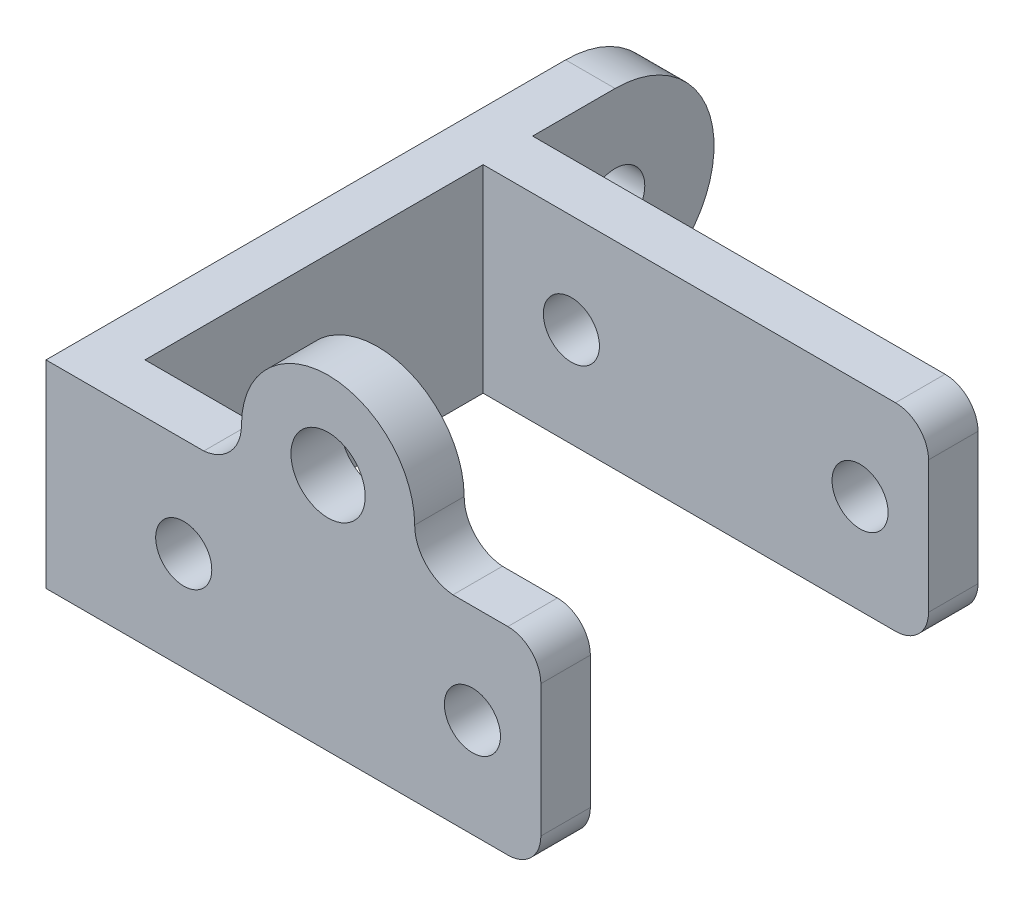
ISO-10303-21;
HEADER;
FILE_DESCRIPTION(('STEP AP214'),'2;1');
FILE_NAME('part.step','',(''),(''),'','','');
FILE_SCHEMA(('AUTOMOTIVE_DESIGN { 1 0 10303 214 1 1 1 1 }'));
ENDSEC;
DATA;
#1=APPLICATION_CONTEXT('core data for automotive mechanical design processes');
#2=APPLICATION_PROTOCOL_DEFINITION('international standard','automotive_design',2000,#1);
#3=PRODUCT_CONTEXT('',#1,'mechanical');
#4=PRODUCT('Part','Part','',(#3));
#5=PRODUCT_RELATED_PRODUCT_CATEGORY('part','',(#4));
#6=PRODUCT_DEFINITION_FORMATION('','',#4);
#7=PRODUCT_DEFINITION_CONTEXT('part definition',#1,'design');
#8=PRODUCT_DEFINITION('design','',#6,#7);
#9=PRODUCT_DEFINITION_SHAPE('','',#8);
#10=(LENGTH_UNIT() NAMED_UNIT(*) SI_UNIT(.MILLI.,.METRE.));
#11=(NAMED_UNIT(*) PLANE_ANGLE_UNIT() SI_UNIT($,.RADIAN.));
#12=(NAMED_UNIT(*) SI_UNIT($,.STERADIAN.) SOLID_ANGLE_UNIT());
#13=UNCERTAINTY_MEASURE_WITH_UNIT(LENGTH_MEASURE(1.E-05),#10,'distance_accuracy_value','');
#14=(GEOMETRIC_REPRESENTATION_CONTEXT(3) GLOBAL_UNCERTAINTY_ASSIGNED_CONTEXT((#13)) GLOBAL_UNIT_ASSIGNED_CONTEXT((#10,
#11,#12)) REPRESENTATION_CONTEXT('',''));
#15=CARTESIAN_POINT('',(0.,0.,0.));
#16=DIRECTION('',(0.,0.,1.));
#17=DIRECTION('',(1.,0.,0.));
#18=AXIS2_PLACEMENT_3D('',#15,#16,#17);
#19=CARTESIAN_POINT('',(-15.,6.,26.5));
#20=DIRECTION('',(0.,-1.,0.));
#21=DIRECTION('',(0.,0.,-1.));
#22=AXIS2_PLACEMENT_3D('',#19,#20,#21);
#23=PLANE('',#22);
#24=DIRECTION('',(-1.,0.,0.));
#25=VECTOR('',#24,1.);
#26=CARTESIAN_POINT('',(-15.,6.,3.));
#27=LINE('',#26,#25);
#28=CARTESIAN_POINT('',(13.,6.,3.));
#29=VERTEX_POINT('',#28);
#30=CARTESIAN_POINT('',(-12.,6.,3.));
#31=VERTEX_POINT('',#30);
#32=EDGE_CURVE('E288',#29,#31,#27,.T.);
#33=ORIENTED_EDGE('',*,*,#32,.F.);
#34=DIRECTION('',(0.,0.,-1.));
#35=VECTOR('',#34,1.);
#36=CARTESIAN_POINT('',(13.,6.,26.5));
#37=LINE('',#36,#35);
#38=CARTESIAN_POINT('',(13.,6.,0.));
#39=VERTEX_POINT('',#38);
#40=EDGE_CURVE('E255',#29,#39,#37,.T.);
#41=ORIENTED_EDGE('',*,*,#40,.T.);
#42=DIRECTION('',(-1.,0.,0.));
#43=VECTOR('',#42,1.);
#44=CARTESIAN_POINT('',(-15.,6.,0.));
#45=LINE('',#44,#43);
#46=CARTESIAN_POINT('',(-12.,6.,0.));
#47=VERTEX_POINT('',#46);
#48=EDGE_CURVE('E188',#39,#47,#45,.T.);
#49=ORIENTED_EDGE('',*,*,#48,.T.);
#50=DIRECTION('',(0.,0.,-1.));
#51=VECTOR('',#50,1.);
#52=CARTESIAN_POINT('',(-12.,6.,-4.99999999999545));
#53=LINE('',#52,#51);
#54=CARTESIAN_POINT('',(-12.,6.,-4.99999999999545));
#55=VERTEX_POINT('',#54);
#56=EDGE_CURVE('E168',#47,#55,#53,.T.);
#57=ORIENTED_EDGE('',*,*,#56,.T.);
#58=DIRECTION('',(-1.,0.,0.));
#59=VECTOR('',#58,1.);
#60=CARTESIAN_POINT('',(4.27882059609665,6.,-4.99999999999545));
#61=LINE('',#60,#59);
#62=CARTESIAN_POINT('',(-15.,6.,-4.99999999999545));
#63=VERTEX_POINT('',#62);
#64=EDGE_CURVE('E172',#55,#63,#61,.T.);
#65=ORIENTED_EDGE('',*,*,#64,.T.);
#66=DIRECTION('',(0.,0.,-1.));
#67=VECTOR('',#66,1.);
#68=CARTESIAN_POINT('',(-15.,6.,26.5));
#69=LINE('',#68,#67);
#70=CARTESIAN_POINT('',(-15.,6.,26.5));
#71=VERTEX_POINT('',#70);
#72=EDGE_CURVE('E207',#71,#63,#69,.T.);
#73=ORIENTED_EDGE('',*,*,#72,.F.);
#74=DIRECTION('',(-1.,0.,0.));
#75=VECTOR('',#74,1.);
#76=CARTESIAN_POINT('',(-15.,6.,26.5));
#77=LINE('',#76,#75);
#78=CARTESIAN_POINT('',(-5.43354923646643,6.,26.5));
#79=VERTEX_POINT('',#78);
#80=EDGE_CURVE('E190',#79,#71,#77,.T.);
#81=ORIENTED_EDGE('',*,*,#80,.F.);
#82=DIRECTION('',(0.,0.,1.));
#83=VECTOR('',#82,1.);
#84=CARTESIAN_POINT('',(-5.43354923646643,6.,23.5));
#85=LINE('',#84,#83);
#86=CARTESIAN_POINT('',(-5.43354923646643,6.,23.5));
#87=VERTEX_POINT('',#86);
#88=EDGE_CURVE('E361',#87,#79,#85,.T.);
#89=ORIENTED_EDGE('',*,*,#88,.F.);
#90=DIRECTION('',(-1.,0.,0.));
#91=VECTOR('',#90,1.);
#92=CARTESIAN_POINT('',(-15.,6.,23.5));
#93=LINE('',#92,#91);
#94=CARTESIAN_POINT('',(-12.,6.,23.5));
#95=VERTEX_POINT('',#94);
#96=EDGE_CURVE('E224',#87,#95,#93,.T.);
#97=ORIENTED_EDGE('',*,*,#96,.T.);
#98=DIRECTION('',(0.,0.,-1.));
#99=VECTOR('',#98,1.);
#100=CARTESIAN_POINT('',(-12.,6.,26.5));
#101=LINE('',#100,#99);
#102=EDGE_CURVE('E264',#95,#31,#101,.T.);
#103=ORIENTED_EDGE('',*,*,#102,.T.);
#104=EDGE_LOOP('',(#33,#41,#49,#57,#65,#73,#81,#89,#97,#103));
#105=FACE_BOUND('',#104,.T.);
#106=ADVANCED_FACE('F35',(#105),#23,.F.);
#107=CARTESIAN_POINT('',(15.,6.,26.5));
#108=DIRECTION('',(-1.,0.,0.));
#109=DIRECTION('',(0.,-1.,0.));
#110=AXIS2_PLACEMENT_3D('',#107,#108,#109);
#111=PLANE('',#110);
#112=DIRECTION('',(0.,1.,0.));
#113=VECTOR('',#112,1.);
#114=CARTESIAN_POINT('',(15.,6.,3.));
#115=LINE('',#114,#113);
#116=CARTESIAN_POINT('',(15.,-4.,3.));
#117=VERTEX_POINT('',#116);
#118=CARTESIAN_POINT('',(15.,4.,3.));
#119=VERTEX_POINT('',#118);
#120=EDGE_CURVE('E286',#117,#119,#115,.T.);
#121=ORIENTED_EDGE('',*,*,#120,.F.);
#122=DIRECTION('',(0.,0.,-1.));
#123=VECTOR('',#122,1.);
#124=CARTESIAN_POINT('',(15.,-4.,26.5));
#125=LINE('',#124,#123);
#126=CARTESIAN_POINT('',(15.,-4.,0.));
#127=VERTEX_POINT('',#126);
#128=EDGE_CURVE('E315',#117,#127,#125,.T.);
#129=ORIENTED_EDGE('',*,*,#128,.T.);
#130=DIRECTION('',(0.,1.,0.));
#131=VECTOR('',#130,1.);
#132=CARTESIAN_POINT('',(15.,6.,0.));
#133=LINE('',#132,#131);
#134=CARTESIAN_POINT('',(15.,4.,0.));
#135=VERTEX_POINT('',#134);
#136=EDGE_CURVE('E192',#127,#135,#133,.T.);
#137=ORIENTED_EDGE('',*,*,#136,.T.);
#138=DIRECTION('',(0.,0.,-1.));
#139=VECTOR('',#138,1.);
#140=CARTESIAN_POINT('',(15.,4.,26.5));
#141=LINE('',#140,#139);
#142=EDGE_CURVE('E210',#135,#119,#141,.F.);
#143=ORIENTED_EDGE('',*,*,#142,.T.);
#144=EDGE_LOOP('',(#121,#129,#137,#143));
#145=FACE_BOUND('',#144,.T.);
#146=ADVANCED_FACE('F320',(#145),#111,.F.);
#147=CARTESIAN_POINT('',(13.,6.,26.5));
#148=VERTEX_POINT('',#147);
#149=CARTESIAN_POINT('',(9.66914453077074,6.,26.5));
#150=VERTEX_POINT('',#149);
#151=EDGE_CURVE('E223',#148,#150,#77,.T.);
#152=ORIENTED_EDGE('',*,*,#151,.F.);
#153=DIRECTION('',(0.,0.,-1.));
#154=VECTOR('',#153,1.);
#155=CARTESIAN_POINT('',(13.,6.,26.5));
#156=LINE('',#155,#154);
#157=CARTESIAN_POINT('',(13.,6.,23.5));
#158=VERTEX_POINT('',#157);
#159=EDGE_CURVE('E11',#148,#158,#156,.T.);
#160=ORIENTED_EDGE('',*,*,#159,.T.);
#161=CARTESIAN_POINT('',(9.66914453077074,6.,23.5));
#162=VERTEX_POINT('',#161);
#163=EDGE_CURVE('E259',#158,#162,#93,.T.);
#164=ORIENTED_EDGE('',*,*,#163,.T.);
#165=DIRECTION('',(0.,0.,1.));
#166=VECTOR('',#165,1.);
#167=CARTESIAN_POINT('',(9.66914453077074,6.,23.5));
#168=LINE('',#167,#166);
#169=EDGE_CURVE('E352',#162,#150,#168,.T.);
#170=ORIENTED_EDGE('',*,*,#169,.T.);
#171=EDGE_LOOP('',(#152,#160,#164,#170));
#172=FACE_BOUND('',#171,.T.);
#173=ADVANCED_FACE('F383',(#172),#23,.F.);
#174=CARTESIAN_POINT('',(-15.,-6.,26.5));
#175=DIRECTION('',(0.,1.,0.));
#176=DIRECTION('',(0.,0.,1.));
#177=AXIS2_PLACEMENT_3D('',#174,#175,#176);
#178=PLANE('',#177);
#179=DIRECTION('',(1.,0.,0.));
#180=VECTOR('',#179,1.);
#181=CARTESIAN_POINT('',(-15.,-6.,0.));
#182=LINE('',#181,#180);
#183=CARTESIAN_POINT('',(-12.,-6.,0.));
#184=VERTEX_POINT('',#183);
#185=CARTESIAN_POINT('',(13.,-6.,0.));
#186=VERTEX_POINT('',#185);
#187=EDGE_CURVE('E178',#184,#186,#182,.T.);
#188=ORIENTED_EDGE('',*,*,#187,.T.);
#189=DIRECTION('',(0.,0.,-1.));
#190=VECTOR('',#189,1.);
#191=CARTESIAN_POINT('',(13.,-6.,26.5));
#192=LINE('',#191,#190);
#193=CARTESIAN_POINT('',(13.,-6.,3.));
#194=VERTEX_POINT('',#193);
#195=EDGE_CURVE('E297',#186,#194,#192,.F.);
#196=ORIENTED_EDGE('',*,*,#195,.T.);
#197=DIRECTION('',(1.,0.,0.));
#198=VECTOR('',#197,1.);
#199=CARTESIAN_POINT('',(-15.,-6.,3.));
#200=LINE('',#199,#198);
#201=CARTESIAN_POINT('',(-12.,-6.,3.));
#202=VERTEX_POINT('',#201);
#203=EDGE_CURVE('E268',#202,#194,#200,.T.);
#204=ORIENTED_EDGE('',*,*,#203,.F.);
#205=DIRECTION('',(0.,0.,-1.));
#206=VECTOR('',#205,1.);
#207=CARTESIAN_POINT('',(-12.,-6.,26.5));
#208=LINE('',#207,#206);
#209=CARTESIAN_POINT('',(-12.,-6.,23.5));
#210=VERTEX_POINT('',#209);
#211=EDGE_CURVE('E271',#210,#202,#208,.T.);
#212=ORIENTED_EDGE('',*,*,#211,.F.);
#213=DIRECTION('',(1.,0.,0.));
#214=VECTOR('',#213,1.);
#215=CARTESIAN_POINT('',(-15.,-6.,23.5));
#216=LINE('',#215,#214);
#217=CARTESIAN_POINT('',(13.,-6.,23.5));
#218=VERTEX_POINT('',#217);
#219=EDGE_CURVE('E269',#210,#218,#216,.T.);
#220=ORIENTED_EDGE('',*,*,#219,.T.);
#221=DIRECTION('',(0.,0.,-1.));
#222=VECTOR('',#221,1.);
#223=CARTESIAN_POINT('',(13.,-6.,26.5));
#224=LINE('',#223,#222);
#225=CARTESIAN_POINT('',(13.,-6.,26.5));
#226=VERTEX_POINT('',#225);
#227=EDGE_CURVE('E300',#218,#226,#224,.F.);
#228=ORIENTED_EDGE('',*,*,#227,.T.);
#229=DIRECTION('',(1.,0.,0.));
#230=VECTOR('',#229,1.);
#231=CARTESIAN_POINT('',(-15.,-6.,26.5));
#232=LINE('',#231,#230);
#233=CARTESIAN_POINT('',(-15.,-6.,26.5));
#234=VERTEX_POINT('',#233);
#235=EDGE_CURVE('E208',#234,#226,#232,.T.);
#236=ORIENTED_EDGE('',*,*,#235,.F.);
#237=DIRECTION('',(0.,0.,-1.));
#238=VECTOR('',#237,1.);
#239=CARTESIAN_POINT('',(-15.,-6.,26.5));
#240=LINE('',#239,#238);
#241=CARTESIAN_POINT('',(-15.,-6.,-4.99999999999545));
#242=VERTEX_POINT('',#241);
#243=EDGE_CURVE('E205',#234,#242,#240,.T.);
#244=ORIENTED_EDGE('',*,*,#243,.T.);
#245=DIRECTION('',(-1.,0.,0.));
#246=VECTOR('',#245,1.);
#247=CARTESIAN_POINT('',(4.27882059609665,-6.,-4.99999999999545));
#248=LINE('',#247,#246);
#249=CARTESIAN_POINT('',(-12.,-6.,-4.99999999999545));
#250=VERTEX_POINT('',#249);
#251=EDGE_CURVE('E181',#250,#242,#248,.T.);
#252=ORIENTED_EDGE('',*,*,#251,.F.);
#253=DIRECTION('',(0.,0.,1.));
#254=VECTOR('',#253,1.);
#255=CARTESIAN_POINT('',(-12.,-6.,0.));
#256=LINE('',#255,#254);
#257=EDGE_CURVE('E165',#250,#184,#256,.T.);
#258=ORIENTED_EDGE('',*,*,#257,.T.);
#259=EDGE_LOOP('',(#188,#196,#204,#212,#220,#228,#236,#244,#252,#258));
#260=FACE_BOUND('',#259,.T.);
#261=ADVANCED_FACE('F177',(#260),#178,.F.);
#262=DIRECTION('',(0.,1.,0.));
#263=VECTOR('',#262,1.);
#264=CARTESIAN_POINT('',(15.,6.,26.5));
#265=LINE('',#264,#263);
#266=CARTESIAN_POINT('',(15.,-4.,26.5));
#267=VERTEX_POINT('',#266);
#268=CARTESIAN_POINT('',(15.,4.,26.5));
#269=VERTEX_POINT('',#268);
#270=EDGE_CURVE('E187',#267,#269,#265,.T.);
#271=ORIENTED_EDGE('',*,*,#270,.F.);
#272=DIRECTION('',(0.,0.,-1.));
#273=VECTOR('',#272,1.);
#274=CARTESIAN_POINT('',(15.,-4.,26.5));
#275=LINE('',#274,#273);
#276=CARTESIAN_POINT('',(15.,-4.,23.5));
#277=VERTEX_POINT('',#276);
#278=EDGE_CURVE('E250',#267,#277,#275,.T.);
#279=ORIENTED_EDGE('',*,*,#278,.T.);
#280=DIRECTION('',(0.,1.,0.));
#281=VECTOR('',#280,1.);
#282=CARTESIAN_POINT('',(15.,6.,23.5));
#283=LINE('',#282,#281);
#284=CARTESIAN_POINT('',(15.,4.,23.5));
#285=VERTEX_POINT('',#284);
#286=EDGE_CURVE('E266',#277,#285,#283,.T.);
#287=ORIENTED_EDGE('',*,*,#286,.T.);
#288=DIRECTION('',(0.,0.,-1.));
#289=VECTOR('',#288,1.);
#290=CARTESIAN_POINT('',(15.,4.,26.5));
#291=LINE('',#290,#289);
#292=EDGE_CURVE('E252',#285,#269,#291,.F.);
#293=ORIENTED_EDGE('',*,*,#292,.T.);
#294=EDGE_LOOP('',(#271,#279,#287,#293));
#295=FACE_BOUND('',#294,.T.);
#296=ADVANCED_FACE('F248',(#295),#111,.F.);
#297=CARTESIAN_POINT('',(-15.,6.,26.5));
#298=DIRECTION('',(1.,0.,0.));
#299=DIRECTION('',(0.,1.,0.));
#300=AXIS2_PLACEMENT_3D('',#297,#298,#299);
#301=PLANE('',#300);
#302=ORIENTED_EDGE('',*,*,#72,.T.);
#303=CARTESIAN_POINT('',(-15.,0.,-4.99999999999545));
#304=DIRECTION('',(-1.,0.,0.));
#305=DIRECTION('',(0.,-1.,0.));
#306=AXIS2_PLACEMENT_3D('',#303,#304,#305);
#307=CIRCLE('',#306,6.);
#308=EDGE_CURVE('E433',#63,#242,#307,.T.);
#309=ORIENTED_EDGE('',*,*,#308,.T.);
#310=ORIENTED_EDGE('',*,*,#243,.F.);
#311=DIRECTION('',(0.,-1.,0.));
#312=VECTOR('',#311,1.);
#313=CARTESIAN_POINT('',(-15.,6.,26.5));
#314=LINE('',#313,#312);
#315=EDGE_CURVE('E230',#71,#234,#314,.T.);
#316=ORIENTED_EDGE('',*,*,#315,.F.);
#317=EDGE_LOOP('',(#302,#309,#310,#316));
#318=FACE_BOUND('',#317,.T.);
#319=CARTESIAN_POINT('',(-15.,0.,-4.99999999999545));
#320=DIRECTION('',(-1.,0.,0.));
#321=DIRECTION('',(0.,-1.,0.));
#322=AXIS2_PLACEMENT_3D('',#319,#320,#321);
#323=CIRCLE('',#322,1.8);
#324=CARTESIAN_POINT('',(-15.,-1.8,-4.99999999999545));
#325=VERTEX_POINT('',#324);
#326=EDGE_CURVE('E182',#325,#325,#323,.T.);
#327=ORIENTED_EDGE('',*,*,#326,.F.);
#328=EDGE_LOOP('',(#327));
#329=FACE_BOUND('',#328,.T.);
#330=ADVANCED_FACE('F419',(#318,#329),#301,.F.);
#331=CARTESIAN_POINT('',(0.,0.,26.5));
#332=DIRECTION('',(0.,0.,1.));
#333=DIRECTION('',(1.,0.,0.));
#334=AXIS2_PLACEMENT_3D('',#331,#332,#333);
#335=PLANE('',#334);
#336=CARTESIAN_POINT('',(2.10000000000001,8.49999999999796,26.5));
#337=DIRECTION('',(0.,0.,1.));
#338=DIRECTION('',(-1.,0.,0.));
#339=AXIS2_PLACEMENT_3D('',#336,#337,#338);
#340=CIRCLE('',#339,2.25);
#341=CARTESIAN_POINT('',(-0.149999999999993,8.49999999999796,26.5));
#342=VERTEX_POINT('',#341);
#343=EDGE_CURVE('E679',#342,#342,#340,.T.);
#344=ORIENTED_EDGE('',*,*,#343,.F.);
#345=EDGE_LOOP('',(#344));
#346=FACE_BOUND('',#345,.T.);
#347=CARTESIAN_POINT('',(10.85,0.,26.5));
#348=DIRECTION('',(0.,0.,1.));
#349=DIRECTION('',(1.,0.,0.));
#350=AXIS2_PLACEMENT_3D('',#347,#348,#349);
#351=CIRCLE('',#350,1.7);
#352=CARTESIAN_POINT('',(12.55,0.,26.5));
#353=VERTEX_POINT('',#352);
#354=EDGE_CURVE('E351',#353,#353,#351,.T.);
#355=ORIENTED_EDGE('',*,*,#354,.F.);
#356=EDGE_LOOP('',(#355));
#357=FACE_BOUND('',#356,.T.);
#358=CARTESIAN_POINT('',(-6.64999999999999,0.,26.5));
#359=DIRECTION('',(0.,0.,1.));
#360=DIRECTION('',(1.,0.,0.));
#361=AXIS2_PLACEMENT_3D('',#358,#359,#360);
#362=CIRCLE('',#361,1.7);
#363=CARTESIAN_POINT('',(-4.94999999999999,0.,26.5));
#364=VERTEX_POINT('',#363);
#365=EDGE_CURVE('E486',#364,#364,#362,.T.);
#366=ORIENTED_EDGE('',*,*,#365,.F.);
#367=EDGE_LOOP('',(#366));
#368=FACE_BOUND('',#367,.T.);
#369=ORIENTED_EDGE('',*,*,#235,.T.);
#370=CARTESIAN_POINT('',(13.,-4.,26.5));
#371=DIRECTION('',(0.,0.,1.));
#372=DIRECTION('',(1.,0.,0.));
#373=AXIS2_PLACEMENT_3D('',#370,#371,#372);
#374=CIRCLE('',#373,2.);
#375=EDGE_CURVE('E43',#226,#267,#374,.T.);
#376=ORIENTED_EDGE('',*,*,#375,.T.);
#377=ORIENTED_EDGE('',*,*,#270,.T.);
#378=CARTESIAN_POINT('',(13.,4.,26.5));
#379=DIRECTION('',(0.,0.,1.));
#380=DIRECTION('',(1.,0.,0.));
#381=AXIS2_PLACEMENT_3D('',#378,#379,#380);
#382=CIRCLE('',#381,2.);
#383=EDGE_CURVE('E50',#269,#148,#382,.T.);
#384=ORIENTED_EDGE('',*,*,#383,.T.);
#385=ORIENTED_EDGE('',*,*,#151,.T.);
#386=CARTESIAN_POINT('',(9.8570518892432,8.49999999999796,26.5));
#387=DIRECTION('',(0.,0.,-1.));
#388=DIRECTION('',(1.,0.,0.));
#389=AXIS2_PLACEMENT_3D('',#386,#387,#388);
#390=CIRCLE('',#389,2.50705188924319);
#391=CARTESIAN_POINT('',(7.35000000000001,8.49999999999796,26.5));
#392=VERTEX_POINT('',#391);
#393=EDGE_CURVE('E343',#150,#392,#390,.T.);
#394=ORIENTED_EDGE('',*,*,#393,.T.);
#395=CARTESIAN_POINT('',(2.10000000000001,8.49999999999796,26.5));
#396=DIRECTION('',(0.,0.,1.));
#397=DIRECTION('',(-1.,0.,0.));
#398=AXIS2_PLACEMENT_3D('',#395,#396,#397);
#399=CIRCLE('',#398,5.25);
#400=CARTESIAN_POINT('',(-3.14999999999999,8.49999999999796,26.5));
#401=VERTEX_POINT('',#400);
#402=EDGE_CURVE('E344',#392,#401,#399,.T.);
#403=ORIENTED_EDGE('',*,*,#402,.T.);
#404=CARTESIAN_POINT('',(-5.66025835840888,8.49999999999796,26.5));
#405=DIRECTION('',(0.,0.,-1.));
#406=DIRECTION('',(-1.,0.,0.));
#407=AXIS2_PLACEMENT_3D('',#404,#405,#406);
#408=CIRCLE('',#407,2.51025835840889);
#409=EDGE_CURVE('E347',#401,#79,#408,.T.);
#410=ORIENTED_EDGE('',*,*,#409,.T.);
#411=ORIENTED_EDGE('',*,*,#80,.T.);
#412=ORIENTED_EDGE('',*,*,#315,.T.);
#413=EDGE_LOOP('',(#369,#376,#377,#384,#385,#394,#403,#410,#411,#412));
#414=FACE_BOUND('',#413,.T.);
#415=ADVANCED_FACE('F241',(#346,#357,#368,#414),#335,.T.);
#416=CARTESIAN_POINT('',(0.,0.,0.));
#417=DIRECTION('',(0.,0.,1.));
#418=DIRECTION('',(1.,0.,0.));
#419=AXIS2_PLACEMENT_3D('',#416,#417,#418);
#420=PLANE('',#419);
#421=CARTESIAN_POINT('',(10.85,0.,0.));
#422=DIRECTION('',(0.,0.,1.));
#423=DIRECTION('',(1.,0.,0.));
#424=AXIS2_PLACEMENT_3D('',#421,#422,#423);
#425=CIRCLE('',#424,1.7);
#426=CARTESIAN_POINT('',(12.55,0.,0.));
#427=VERTEX_POINT('',#426);
#428=EDGE_CURVE('E220',#427,#427,#425,.T.);
#429=ORIENTED_EDGE('',*,*,#428,.T.);
#430=EDGE_LOOP('',(#429));
#431=FACE_BOUND('',#430,.T.);
#432=CARTESIAN_POINT('',(-6.64999999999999,0.,0.));
#433=DIRECTION('',(0.,0.,1.));
#434=DIRECTION('',(1.,0.,0.));
#435=AXIS2_PLACEMENT_3D('',#432,#433,#434);
#436=CIRCLE('',#435,1.7);
#437=CARTESIAN_POINT('',(-4.94999999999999,0.,0.));
#438=VERTEX_POINT('',#437);
#439=EDGE_CURVE('E215',#438,#438,#436,.T.);
#440=ORIENTED_EDGE('',*,*,#439,.T.);
#441=EDGE_LOOP('',(#440));
#442=FACE_BOUND('',#441,.T.);
#443=ORIENTED_EDGE('',*,*,#136,.F.);
#444=CARTESIAN_POINT('',(13.,-4.,0.));
#445=DIRECTION('',(0.,0.,1.));
#446=DIRECTION('',(1.,0.,0.));
#447=AXIS2_PLACEMENT_3D('',#444,#445,#446);
#448=CIRCLE('',#447,2.);
#449=EDGE_CURVE('E186',#127,#186,#448,.F.);
#450=ORIENTED_EDGE('',*,*,#449,.T.);
#451=ORIENTED_EDGE('',*,*,#187,.F.);
#452=DIRECTION('',(0.,1.,0.));
#453=VECTOR('',#452,1.);
#454=CARTESIAN_POINT('',(-12.,6.,0.));
#455=LINE('',#454,#453);
#456=EDGE_CURVE('E161',#184,#47,#455,.T.);
#457=ORIENTED_EDGE('',*,*,#456,.T.);
#458=ORIENTED_EDGE('',*,*,#48,.F.);
#459=CARTESIAN_POINT('',(13.,4.,0.));
#460=DIRECTION('',(0.,0.,1.));
#461=DIRECTION('',(1.,0.,0.));
#462=AXIS2_PLACEMENT_3D('',#459,#460,#461);
#463=CIRCLE('',#462,2.);
#464=EDGE_CURVE('E312',#39,#135,#463,.F.);
#465=ORIENTED_EDGE('',*,*,#464,.T.);
#466=EDGE_LOOP('',(#443,#450,#451,#457,#458,#465));
#467=FACE_BOUND('',#466,.T.);
#468=ADVANCED_FACE('F185',(#431,#442,#467),#420,.F.);
#469=CARTESIAN_POINT('',(-12.,6.,26.5));
#470=DIRECTION('',(1.,0.,0.));
#471=DIRECTION('',(0.,1.,0.));
#472=AXIS2_PLACEMENT_3D('',#469,#470,#471);
#473=PLANE('',#472);
#474=DIRECTION('',(0.,-1.,0.));
#475=VECTOR('',#474,1.);
#476=CARTESIAN_POINT('',(-12.,6.,3.));
#477=LINE('',#476,#475);
#478=EDGE_CURVE('E281',#31,#202,#477,.T.);
#479=ORIENTED_EDGE('',*,*,#478,.F.);
#480=ORIENTED_EDGE('',*,*,#102,.F.);
#481=DIRECTION('',(0.,-1.,0.));
#482=VECTOR('',#481,1.);
#483=CARTESIAN_POINT('',(-12.,6.,23.5));
#484=LINE('',#483,#482);
#485=EDGE_CURVE('E260',#95,#210,#484,.T.);
#486=ORIENTED_EDGE('',*,*,#485,.T.);
#487=ORIENTED_EDGE('',*,*,#211,.T.);
#488=EDGE_LOOP('',(#479,#480,#486,#487));
#489=FACE_BOUND('',#488,.T.);
#490=ADVANCED_FACE('F296',(#489),#473,.T.);
#491=CARTESIAN_POINT('',(0.,0.,23.5));
#492=DIRECTION('',(0.,0.,1.));
#493=DIRECTION('',(1.,0.,0.));
#494=AXIS2_PLACEMENT_3D('',#491,#492,#493);
#495=PLANE('',#494);
#496=CARTESIAN_POINT('',(2.10000000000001,8.49999999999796,23.5));
#497=DIRECTION('',(0.,0.,1.));
#498=DIRECTION('',(1.,0.,0.));
#499=AXIS2_PLACEMENT_3D('',#496,#497,#498);
#500=CIRCLE('',#499,2.25);
#501=CARTESIAN_POINT('',(4.35000000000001,8.49999999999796,23.5));
#502=VERTEX_POINT('',#501);
#503=EDGE_CURVE('E336',#502,#502,#500,.F.);
#504=ORIENTED_EDGE('',*,*,#503,.F.);
#505=EDGE_LOOP('',(#504));
#506=FACE_BOUND('',#505,.T.);
#507=CARTESIAN_POINT('',(10.85,0.,23.5));
#508=DIRECTION('',(0.,0.,1.));
#509=DIRECTION('',(1.,0.,0.));
#510=AXIS2_PLACEMENT_3D('',#507,#508,#509);
#511=CIRCLE('',#510,1.7);
#512=CARTESIAN_POINT('',(12.55,0.,23.5));
#513=VERTEX_POINT('',#512);
#514=EDGE_CURVE('E219',#513,#513,#511,.T.);
#515=ORIENTED_EDGE('',*,*,#514,.T.);
#516=EDGE_LOOP('',(#515));
#517=FACE_BOUND('',#516,.T.);
#518=CARTESIAN_POINT('',(-6.64999999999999,0.,23.5));
#519=DIRECTION('',(0.,0.,1.));
#520=DIRECTION('',(1.,0.,0.));
#521=AXIS2_PLACEMENT_3D('',#518,#519,#520);
#522=CIRCLE('',#521,1.7);
#523=CARTESIAN_POINT('',(-4.94999999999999,0.,23.5));
#524=VERTEX_POINT('',#523);
#525=EDGE_CURVE('E214',#524,#524,#522,.T.);
#526=ORIENTED_EDGE('',*,*,#525,.T.);
#527=EDGE_LOOP('',(#526));
#528=FACE_BOUND('',#527,.T.);
#529=ORIENTED_EDGE('',*,*,#286,.F.);
#530=CARTESIAN_POINT('',(13.,-4.,23.5));
#531=DIRECTION('',(0.,0.,1.));
#532=DIRECTION('',(1.,0.,0.));
#533=AXIS2_PLACEMENT_3D('',#530,#531,#532);
#534=CIRCLE('',#533,2.);
#535=EDGE_CURVE('E236',#277,#218,#534,.F.);
#536=ORIENTED_EDGE('',*,*,#535,.T.);
#537=ORIENTED_EDGE('',*,*,#219,.F.);
#538=ORIENTED_EDGE('',*,*,#485,.F.);
#539=ORIENTED_EDGE('',*,*,#96,.F.);
#540=CARTESIAN_POINT('',(-5.66025835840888,8.49999999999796,23.5));
#541=DIRECTION('',(0.,0.,-1.));
#542=DIRECTION('',(-1.,0.,0.));
#543=AXIS2_PLACEMENT_3D('',#540,#541,#542);
#544=CIRCLE('',#543,2.51025835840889);
#545=CARTESIAN_POINT('',(-3.14999999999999,8.49999999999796,23.5));
#546=VERTEX_POINT('',#545);
#547=EDGE_CURVE('E342',#546,#87,#544,.T.);
#548=ORIENTED_EDGE('',*,*,#547,.F.);
#549=CARTESIAN_POINT('',(2.10000000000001,8.49999999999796,23.5));
#550=DIRECTION('',(0.,0.,1.));
#551=DIRECTION('',(-1.,0.,0.));
#552=AXIS2_PLACEMENT_3D('',#549,#550,#551);
#553=CIRCLE('',#552,5.25);
#554=CARTESIAN_POINT('',(7.35000000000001,8.49999999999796,23.5));
#555=VERTEX_POINT('',#554);
#556=EDGE_CURVE('E339',#555,#546,#553,.T.);
#557=ORIENTED_EDGE('',*,*,#556,.F.);
#558=CARTESIAN_POINT('',(9.8570518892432,8.49999999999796,23.5));
#559=DIRECTION('',(0.,0.,-1.));
#560=DIRECTION('',(1.,0.,0.));
#561=AXIS2_PLACEMENT_3D('',#558,#559,#560);
#562=CIRCLE('',#561,2.50705188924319);
#563=EDGE_CURVE('E363',#162,#555,#562,.T.);
#564=ORIENTED_EDGE('',*,*,#563,.F.);
#565=ORIENTED_EDGE('',*,*,#163,.F.);
#566=CARTESIAN_POINT('',(13.,4.,23.5));
#567=DIRECTION('',(0.,0.,1.));
#568=DIRECTION('',(1.,0.,0.));
#569=AXIS2_PLACEMENT_3D('',#566,#567,#568);
#570=CIRCLE('',#569,2.);
#571=EDGE_CURVE('E58',#158,#285,#570,.F.);
#572=ORIENTED_EDGE('',*,*,#571,.T.);
#573=EDGE_LOOP('',(#529,#536,#537,#538,#539,#548,#557,#564,#565,#572));
#574=FACE_BOUND('',#573,.T.);
#575=ADVANCED_FACE('F386',(#506,#517,#528,#574),#495,.F.);
#576=CARTESIAN_POINT('',(0.,0.,3.));
#577=DIRECTION('',(0.,0.,1.));
#578=DIRECTION('',(1.,0.,0.));
#579=AXIS2_PLACEMENT_3D('',#576,#577,#578);
#580=PLANE('',#579);
#581=CARTESIAN_POINT('',(10.85,0.,3.));
#582=DIRECTION('',(0.,0.,1.));
#583=DIRECTION('',(1.,0.,0.));
#584=AXIS2_PLACEMENT_3D('',#581,#582,#583);
#585=CIRCLE('',#584,1.7);
#586=CARTESIAN_POINT('',(12.55,0.,3.));
#587=VERTEX_POINT('',#586);
#588=EDGE_CURVE('E216',#587,#587,#585,.T.);
#589=ORIENTED_EDGE('',*,*,#588,.F.);
#590=EDGE_LOOP('',(#589));
#591=FACE_BOUND('',#590,.T.);
#592=CARTESIAN_POINT('',(-6.64999999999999,0.,3.));
#593=DIRECTION('',(0.,0.,1.));
#594=DIRECTION('',(1.,0.,0.));
#595=AXIS2_PLACEMENT_3D('',#592,#593,#594);
#596=CIRCLE('',#595,1.7);
#597=CARTESIAN_POINT('',(-4.94999999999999,0.,3.));
#598=VERTEX_POINT('',#597);
#599=EDGE_CURVE('E211',#598,#598,#596,.T.);
#600=ORIENTED_EDGE('',*,*,#599,.F.);
#601=EDGE_LOOP('',(#600));
#602=FACE_BOUND('',#601,.T.);
#603=ORIENTED_EDGE('',*,*,#203,.T.);
#604=CARTESIAN_POINT('',(13.,-4.,3.));
#605=DIRECTION('',(0.,0.,1.));
#606=DIRECTION('',(1.,0.,0.));
#607=AXIS2_PLACEMENT_3D('',#604,#605,#606);
#608=CIRCLE('',#607,2.);
#609=EDGE_CURVE('E302',#194,#117,#608,.T.);
#610=ORIENTED_EDGE('',*,*,#609,.T.);
#611=ORIENTED_EDGE('',*,*,#120,.T.);
#612=CARTESIAN_POINT('',(13.,4.,3.));
#613=DIRECTION('',(0.,0.,1.));
#614=DIRECTION('',(1.,0.,0.));
#615=AXIS2_PLACEMENT_3D('',#612,#613,#614);
#616=CIRCLE('',#615,2.);
#617=EDGE_CURVE('E299',#119,#29,#616,.T.);
#618=ORIENTED_EDGE('',*,*,#617,.T.);
#619=ORIENTED_EDGE('',*,*,#32,.T.);
#620=ORIENTED_EDGE('',*,*,#478,.T.);
#621=EDGE_LOOP('',(#603,#610,#611,#618,#619,#620));
#622=FACE_BOUND('',#621,.T.);
#623=ADVANCED_FACE('F292',(#591,#602,#622),#580,.T.);
#624=CARTESIAN_POINT('',(-6.64999999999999,0.,0.));
#625=DIRECTION('',(0.,0.,1.));
#626=DIRECTION('',(1.,0.,0.));
#627=AXIS2_PLACEMENT_3D('',#624,#625,#626);
#628=CYLINDRICAL_SURFACE('',#627,1.7);
#629=ORIENTED_EDGE('',*,*,#599,.T.);
#630=EDGE_LOOP('',(#629));
#631=FACE_BOUND('',#630,.T.);
#632=ORIENTED_EDGE('',*,*,#439,.F.);
#633=EDGE_LOOP('',(#632));
#634=FACE_BOUND('',#633,.T.);
#635=ADVANCED_FACE('F466',(#631,#634),#628,.F.);
#636=ORIENTED_EDGE('',*,*,#365,.T.);
#637=EDGE_LOOP('',(#636));
#638=FACE_BOUND('',#637,.T.);
#639=ORIENTED_EDGE('',*,*,#525,.F.);
#640=EDGE_LOOP('',(#639));
#641=FACE_BOUND('',#640,.T.);
#642=ADVANCED_FACE('F464',(#638,#641),#628,.F.);
#643=CARTESIAN_POINT('',(10.85,0.,0.));
#644=DIRECTION('',(0.,0.,1.));
#645=DIRECTION('',(1.,0.,0.));
#646=AXIS2_PLACEMENT_3D('',#643,#644,#645);
#647=CYLINDRICAL_SURFACE('',#646,1.7);
#648=ORIENTED_EDGE('',*,*,#588,.T.);
#649=EDGE_LOOP('',(#648));
#650=FACE_BOUND('',#649,.T.);
#651=ORIENTED_EDGE('',*,*,#428,.F.);
#652=EDGE_LOOP('',(#651));
#653=FACE_BOUND('',#652,.T.);
#654=ADVANCED_FACE('F461',(#650,#653),#647,.F.);
#655=ORIENTED_EDGE('',*,*,#354,.T.);
#656=EDGE_LOOP('',(#655));
#657=FACE_BOUND('',#656,.T.);
#658=ORIENTED_EDGE('',*,*,#514,.F.);
#659=EDGE_LOOP('',(#658));
#660=FACE_BOUND('',#659,.T.);
#661=ADVANCED_FACE('F460',(#657,#660),#647,.F.);
#662=CARTESIAN_POINT('',(2.10000000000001,8.49999999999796,23.5));
#663=DIRECTION('',(0.,0.,1.));
#664=DIRECTION('',(1.,0.,0.));
#665=AXIS2_PLACEMENT_3D('',#662,#663,#664);
#666=CYLINDRICAL_SURFACE('',#665,5.25);
#667=ORIENTED_EDGE('',*,*,#402,.F.);
#668=DIRECTION('',(0.,0.,1.));
#669=VECTOR('',#668,1.);
#670=CARTESIAN_POINT('',(7.35000000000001,8.49999999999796,23.5));
#671=LINE('',#670,#669);
#672=EDGE_CURVE('E349',#555,#392,#671,.T.);
#673=ORIENTED_EDGE('',*,*,#672,.F.);
#674=ORIENTED_EDGE('',*,*,#556,.T.);
#675=DIRECTION('',(0.,0.,1.));
#676=VECTOR('',#675,1.);
#677=CARTESIAN_POINT('',(-3.14999999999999,8.49999999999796,23.5));
#678=LINE('',#677,#676);
#679=EDGE_CURVE('E366',#546,#401,#678,.T.);
#680=ORIENTED_EDGE('',*,*,#679,.T.);
#681=EDGE_LOOP('',(#667,#673,#674,#680));
#682=FACE_BOUND('',#681,.T.);
#683=ADVANCED_FACE('F391',(#682),#666,.T.);
#684=CARTESIAN_POINT('',(9.8570518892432,8.49999999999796,23.5));
#685=DIRECTION('',(0.,0.,1.));
#686=DIRECTION('',(1.,0.,0.));
#687=AXIS2_PLACEMENT_3D('',#684,#685,#686);
#688=CYLINDRICAL_SURFACE('',#687,2.50705188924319);
#689=ORIENTED_EDGE('',*,*,#393,.F.);
#690=ORIENTED_EDGE('',*,*,#169,.F.);
#691=ORIENTED_EDGE('',*,*,#563,.T.);
#692=ORIENTED_EDGE('',*,*,#672,.T.);
#693=EDGE_LOOP('',(#689,#690,#691,#692));
#694=FACE_BOUND('',#693,.T.);
#695=ADVANCED_FACE('F380',(#694),#688,.F.);
#696=CARTESIAN_POINT('',(-5.66025835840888,8.49999999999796,23.5));
#697=DIRECTION('',(0.,0.,1.));
#698=DIRECTION('',(1.,0.,0.));
#699=AXIS2_PLACEMENT_3D('',#696,#697,#698);
#700=CYLINDRICAL_SURFACE('',#699,2.51025835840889);
#701=ORIENTED_EDGE('',*,*,#409,.F.);
#702=ORIENTED_EDGE('',*,*,#679,.F.);
#703=ORIENTED_EDGE('',*,*,#547,.T.);
#704=ORIENTED_EDGE('',*,*,#88,.T.);
#705=EDGE_LOOP('',(#701,#702,#703,#704));
#706=FACE_BOUND('',#705,.T.);
#707=ADVANCED_FACE('F393',(#706),#700,.F.);
#708=CARTESIAN_POINT('',(4.27882059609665,0.,-4.99999999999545));
#709=DIRECTION('',(-1.,0.,0.));
#710=DIRECTION('',(0.,-1.,0.));
#711=AXIS2_PLACEMENT_3D('',#708,#709,#710);
#712=CYLINDRICAL_SURFACE('',#711,6.);
#713=ORIENTED_EDGE('',*,*,#64,.F.);
#714=CARTESIAN_POINT('',(-12.,0.,-4.99999999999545));
#715=DIRECTION('',(1.,0.,0.));
#716=DIRECTION('',(0.,1.,0.));
#717=AXIS2_PLACEMENT_3D('',#714,#715,#716);
#718=CIRCLE('',#717,6.);
#719=EDGE_CURVE('E331',#55,#250,#718,.F.);
#720=ORIENTED_EDGE('',*,*,#719,.T.);
#721=ORIENTED_EDGE('',*,*,#251,.T.);
#722=ORIENTED_EDGE('',*,*,#308,.F.);
#723=EDGE_LOOP('',(#713,#720,#721,#722));
#724=FACE_BOUND('',#723,.T.);
#725=ADVANCED_FACE('F444',(#724),#712,.T.);
#726=CARTESIAN_POINT('',(4.27882059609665,0.,-4.99999999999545));
#727=DIRECTION('',(-1.,0.,0.));
#728=DIRECTION('',(0.,-1.,0.));
#729=AXIS2_PLACEMENT_3D('',#726,#727,#728);
#730=CYLINDRICAL_SURFACE('',#729,1.8);
#731=ORIENTED_EDGE('',*,*,#326,.T.);
#732=EDGE_LOOP('',(#731));
#733=FACE_BOUND('',#732,.T.);
#734=CARTESIAN_POINT('',(-12.,0.,-4.99999999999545));
#735=DIRECTION('',(1.,0.,0.));
#736=DIRECTION('',(0.,1.,0.));
#737=AXIS2_PLACEMENT_3D('',#734,#735,#736);
#738=CIRCLE('',#737,1.8);
#739=CARTESIAN_POINT('',(-12.,1.8,-4.99999999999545));
#740=VERTEX_POINT('',#739);
#741=EDGE_CURVE('E348',#740,#740,#738,.F.);
#742=ORIENTED_EDGE('',*,*,#741,.F.);
#743=EDGE_LOOP('',(#742));
#744=FACE_BOUND('',#743,.T.);
#745=ADVANCED_FACE('F442',(#733,#744),#730,.F.);
#746=CARTESIAN_POINT('',(-12.,6.,26.5));
#747=DIRECTION('',(1.,0.,0.));
#748=DIRECTION('',(0.,1.,0.));
#749=AXIS2_PLACEMENT_3D('',#746,#747,#748);
#750=PLANE('',#749);
#751=ORIENTED_EDGE('',*,*,#719,.F.);
#752=ORIENTED_EDGE('',*,*,#56,.F.);
#753=ORIENTED_EDGE('',*,*,#456,.F.);
#754=ORIENTED_EDGE('',*,*,#257,.F.);
#755=EDGE_LOOP('',(#751,#752,#753,#754));
#756=FACE_BOUND('',#755,.T.);
#757=ORIENTED_EDGE('',*,*,#741,.T.);
#758=EDGE_LOOP('',(#757));
#759=FACE_BOUND('',#758,.T.);
#760=ADVANCED_FACE('F163',(#756,#759),#750,.T.);
#761=CARTESIAN_POINT('',(13.,-4.,26.5));
#762=DIRECTION('',(0.,0.,-1.));
#763=DIRECTION('',(-1.,0.,0.));
#764=AXIS2_PLACEMENT_3D('',#761,#762,#763);
#765=CYLINDRICAL_SURFACE('',#764,2.);
#766=ORIENTED_EDGE('',*,*,#609,.F.);
#767=ORIENTED_EDGE('',*,*,#195,.F.);
#768=ORIENTED_EDGE('',*,*,#449,.F.);
#769=ORIENTED_EDGE('',*,*,#128,.F.);
#770=EDGE_LOOP('',(#766,#767,#768,#769));
#771=FACE_BOUND('',#770,.T.);
#772=ADVANCED_FACE('F450',(#771),#765,.T.);
#773=CARTESIAN_POINT('',(13.,4.,26.5));
#774=DIRECTION('',(0.,0.,-1.));
#775=DIRECTION('',(-1.,0.,0.));
#776=AXIS2_PLACEMENT_3D('',#773,#774,#775);
#777=CYLINDRICAL_SURFACE('',#776,2.);
#778=ORIENTED_EDGE('',*,*,#617,.F.);
#779=ORIENTED_EDGE('',*,*,#142,.F.);
#780=ORIENTED_EDGE('',*,*,#464,.F.);
#781=ORIENTED_EDGE('',*,*,#40,.F.);
#782=EDGE_LOOP('',(#778,#779,#780,#781));
#783=FACE_BOUND('',#782,.T.);
#784=ADVANCED_FACE('F322',(#783),#777,.T.);
#785=CARTESIAN_POINT('',(13.,-4.,26.5));
#786=DIRECTION('',(0.,0.,-1.));
#787=DIRECTION('',(-1.,0.,0.));
#788=AXIS2_PLACEMENT_3D('',#785,#786,#787);
#789=CYLINDRICAL_SURFACE('',#788,2.);
#790=ORIENTED_EDGE('',*,*,#375,.F.);
#791=ORIENTED_EDGE('',*,*,#227,.F.);
#792=ORIENTED_EDGE('',*,*,#535,.F.);
#793=ORIENTED_EDGE('',*,*,#278,.F.);
#794=EDGE_LOOP('',(#790,#791,#792,#793));
#795=FACE_BOUND('',#794,.T.);
#796=ADVANCED_FACE('F253',(#795),#789,.T.);
#797=CARTESIAN_POINT('',(13.,4.,26.5));
#798=DIRECTION('',(0.,0.,-1.));
#799=DIRECTION('',(-1.,0.,0.));
#800=AXIS2_PLACEMENT_3D('',#797,#798,#799);
#801=CYLINDRICAL_SURFACE('',#800,2.);
#802=ORIENTED_EDGE('',*,*,#383,.F.);
#803=ORIENTED_EDGE('',*,*,#292,.F.);
#804=ORIENTED_EDGE('',*,*,#571,.F.);
#805=ORIENTED_EDGE('',*,*,#159,.F.);
#806=EDGE_LOOP('',(#802,#803,#804,#805));
#807=FACE_BOUND('',#806,.T.);
#808=ADVANCED_FACE('F37',(#807),#801,.T.);
#809=CARTESIAN_POINT('',(2.10000000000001,8.49999999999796,-11.0009999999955));
#810=DIRECTION('',(0.,0.,1.));
#811=DIRECTION('',(1.,0.,0.));
#812=AXIS2_PLACEMENT_3D('',#809,#810,#811);
#813=CYLINDRICAL_SURFACE('',#812,2.25);
#814=ORIENTED_EDGE('',*,*,#343,.T.);
#815=EDGE_LOOP('',(#814));
#816=FACE_BOUND('',#815,.T.);
#817=ORIENTED_EDGE('',*,*,#503,.T.);
#818=EDGE_LOOP('',(#817));
#819=FACE_BOUND('',#818,.T.);
#820=ADVANCED_FACE('F397',(#816,#819),#813,.F.);
#821=CLOSED_SHELL('',(#106,#146,#173,#261,#296,#330,#415,#468,#490,#575,#623,#635,#642,#654,
#661,#683,#695,#707,#725,#745,#760,#772,#784,#796,#808,#820));
#822=MANIFOLD_SOLID_BREP('B2',#821);
#823=ADVANCED_BREP_SHAPE_REPRESENTATION('',(#18,#822),#14);
#824=SHAPE_DEFINITION_REPRESENTATION(#9,#823);
ENDSEC;
END-ISO-10303-21;
